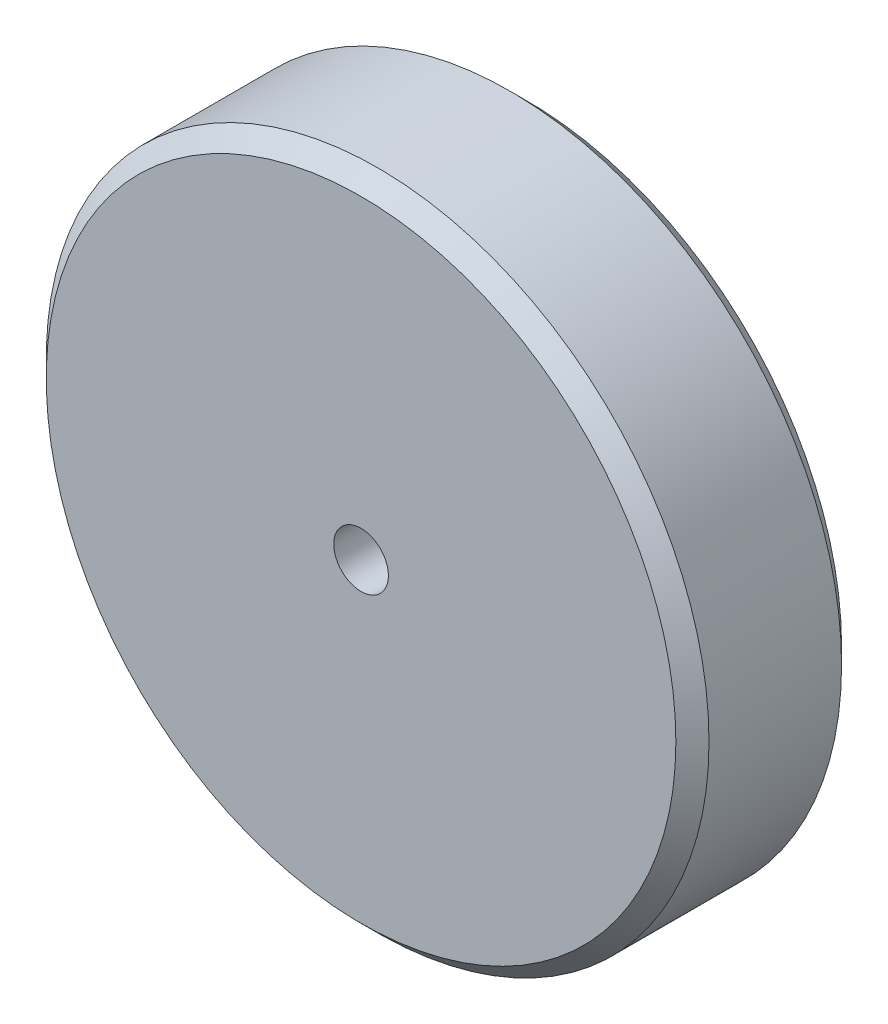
ISO-10303-21;
HEADER;
FILE_DESCRIPTION(('STEP AP214'),'2;1');
FILE_NAME('part.step','',(''),(''),'','','');
FILE_SCHEMA(('AUTOMOTIVE_DESIGN { 1 0 10303 214 1 1 1 1 }'));
ENDSEC;
DATA;
#1=APPLICATION_CONTEXT('core data for automotive mechanical design processes');
#2=APPLICATION_PROTOCOL_DEFINITION('international standard','automotive_design',2000,#1);
#3=PRODUCT_CONTEXT('',#1,'mechanical');
#4=PRODUCT('Part','Part','',(#3));
#5=PRODUCT_RELATED_PRODUCT_CATEGORY('part','',(#4));
#6=PRODUCT_DEFINITION_FORMATION('','',#4);
#7=PRODUCT_DEFINITION_CONTEXT('part definition',#1,'design');
#8=PRODUCT_DEFINITION('design','',#6,#7);
#9=PRODUCT_DEFINITION_SHAPE('','',#8);
#10=(LENGTH_UNIT() NAMED_UNIT(*) SI_UNIT(.MILLI.,.METRE.));
#11=(NAMED_UNIT(*) PLANE_ANGLE_UNIT() SI_UNIT($,.RADIAN.));
#12=(NAMED_UNIT(*) SI_UNIT($,.STERADIAN.) SOLID_ANGLE_UNIT());
#13=UNCERTAINTY_MEASURE_WITH_UNIT(LENGTH_MEASURE(1.E-05),#10,'distance_accuracy_value','');
#14=(GEOMETRIC_REPRESENTATION_CONTEXT(3) GLOBAL_UNCERTAINTY_ASSIGNED_CONTEXT((#13)) GLOBAL_UNIT_ASSIGNED_CONTEXT((#10,
#11,#12)) REPRESENTATION_CONTEXT('',''));
#15=CARTESIAN_POINT('',(0.,0.,0.));
#16=DIRECTION('',(0.,0.,1.));
#17=DIRECTION('',(1.,0.,0.));
#18=AXIS2_PLACEMENT_3D('',#15,#16,#17);
#19=CARTESIAN_POINT('',(0.,0.,10.));
#20=DIRECTION('',(0.,0.,-1.));
#21=DIRECTION('',(-1.,0.,0.));
#22=AXIS2_PLACEMENT_3D('',#19,#20,#21);
#23=CYLINDRICAL_SURFACE('',#22,20.);
#24=CARTESIAN_POINT('',(0.,0.,1.));
#25=DIRECTION('',(0.,0.,1.));
#26=DIRECTION('',(1.,0.,0.));
#27=AXIS2_PLACEMENT_3D('',#24,#25,#26);
#28=CIRCLE('',#27,20.);
#29=CARTESIAN_POINT('',(20.,0.,1.));
#30=VERTEX_POINT('',#29);
#31=EDGE_CURVE('E40',#30,#30,#28,.T.);
#32=ORIENTED_EDGE('',*,*,#31,.T.);
#33=EDGE_LOOP('',(#32));
#34=FACE_BOUND('',#33,.T.);
#35=CARTESIAN_POINT('',(0.,0.,9.00000000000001));
#36=DIRECTION('',(0.,0.,1.));
#37=DIRECTION('',(1.,0.,0.));
#38=AXIS2_PLACEMENT_3D('',#35,#36,#37);
#39=CIRCLE('',#38,20.);
#40=CARTESIAN_POINT('',(20.,0.,9.00000000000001));
#41=VERTEX_POINT('',#40);
#42=EDGE_CURVE('E44',#41,#41,#39,.F.);
#43=ORIENTED_EDGE('',*,*,#42,.T.);
#44=EDGE_LOOP('',(#43));
#45=FACE_BOUND('',#44,.T.);
#46=ADVANCED_FACE('F29',(#34,#45),#23,.T.);
#47=CARTESIAN_POINT('',(0.,0.,10.));
#48=DIRECTION('',(0.,0.,1.));
#49=DIRECTION('',(1.,0.,0.));
#50=AXIS2_PLACEMENT_3D('',#47,#48,#49);
#51=PLANE('',#50);
#52=CARTESIAN_POINT('',(0.,0.,10.));
#53=DIRECTION('',(0.,0.,1.));
#54=DIRECTION('',(1.,0.,0.));
#55=AXIS2_PLACEMENT_3D('',#52,#53,#54);
#56=CIRCLE('',#55,19.);
#57=CARTESIAN_POINT('',(19.,0.,10.));
#58=VERTEX_POINT('',#57);
#59=EDGE_CURVE('E10',#58,#58,#56,.T.);
#60=ORIENTED_EDGE('',*,*,#59,.T.);
#61=EDGE_LOOP('',(#60));
#62=FACE_BOUND('',#61,.T.);
#63=CARTESIAN_POINT('',(0.,0.,10.));
#64=DIRECTION('',(0.,0.,1.));
#65=DIRECTION('',(1.,0.,0.));
#66=AXIS2_PLACEMENT_3D('',#63,#64,#65);
#67=CIRCLE('',#66,1.64999999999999);
#68=CARTESIAN_POINT('',(1.64999999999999,0.,10.));
#69=VERTEX_POINT('',#68);
#70=EDGE_CURVE('E52',#69,#69,#67,.T.);
#71=ORIENTED_EDGE('',*,*,#70,.F.);
#72=EDGE_LOOP('',(#71));
#73=FACE_BOUND('',#72,.T.);
#74=ADVANCED_FACE('F58',(#62,#73),#51,.T.);
#75=CARTESIAN_POINT('',(0.,0.,0.));
#76=DIRECTION('',(0.,0.,1.));
#77=DIRECTION('',(1.,0.,0.));
#78=AXIS2_PLACEMENT_3D('',#75,#76,#77);
#79=PLANE('',#78);
#80=CARTESIAN_POINT('',(0.,0.,0.));
#81=DIRECTION('',(0.,0.,1.));
#82=DIRECTION('',(1.,0.,0.));
#83=AXIS2_PLACEMENT_3D('',#80,#81,#82);
#84=CIRCLE('',#83,19.);
#85=CARTESIAN_POINT('',(19.,0.,0.));
#86=VERTEX_POINT('',#85);
#87=EDGE_CURVE('E36',#86,#86,#84,.F.);
#88=ORIENTED_EDGE('',*,*,#87,.T.);
#89=EDGE_LOOP('',(#88));
#90=FACE_BOUND('',#89,.T.);
#91=CARTESIAN_POINT('',(0.,0.,0.));
#92=DIRECTION('',(0.,0.,1.));
#93=DIRECTION('',(1.,0.,0.));
#94=AXIS2_PLACEMENT_3D('',#91,#92,#93);
#95=CIRCLE('',#94,1.65);
#96=CARTESIAN_POINT('',(1.65,0.,0.));
#97=VERTEX_POINT('',#96);
#98=EDGE_CURVE('E49',#97,#97,#95,.T.);
#99=ORIENTED_EDGE('',*,*,#98,.T.);
#100=EDGE_LOOP('',(#99));
#101=FACE_BOUND('',#100,.T.);
#102=ADVANCED_FACE('F60',(#90,#101),#79,.F.);
#103=CARTESIAN_POINT('',(0.,0.,10.));
#104=DIRECTION('',(0.,0.,1.));
#105=DIRECTION('',(1.,0.,0.));
#106=AXIS2_PLACEMENT_3D('',#103,#104,#105);
#107=CYLINDRICAL_SURFACE('',#106,1.64999999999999);
#108=ORIENTED_EDGE('',*,*,#98,.F.);
#109=EDGE_LOOP('',(#108));
#110=FACE_BOUND('',#109,.T.);
#111=ORIENTED_EDGE('',*,*,#70,.T.);
#112=EDGE_LOOP('',(#111));
#113=FACE_BOUND('',#112,.T.);
#114=ADVANCED_FACE('F56',(#110,#113),#107,.F.);
#115=CARTESIAN_POINT('',(0.,0.,1.));
#116=DIRECTION('',(0.,0.,1.));
#117=DIRECTION('',(1.,0.,0.));
#118=AXIS2_PLACEMENT_3D('',#115,#116,#117);
#119=CONICAL_SURFACE('',#118,20.,0.78539816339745);
#120=ORIENTED_EDGE('',*,*,#87,.F.);
#121=EDGE_LOOP('',(#120));
#122=FACE_BOUND('',#121,.T.);
#123=ORIENTED_EDGE('',*,*,#31,.F.);
#124=EDGE_LOOP('',(#123));
#125=FACE_BOUND('',#124,.T.);
#126=ADVANCED_FACE('F70',(#122,#125),#119,.T.);
#127=CARTESIAN_POINT('',(0.,0.,10.));
#128=DIRECTION('',(0.,0.,-1.));
#129=DIRECTION('',(-1.,0.,0.));
#130=AXIS2_PLACEMENT_3D('',#127,#128,#129);
#131=CONICAL_SURFACE('',#130,19.,0.785398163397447);
#132=ORIENTED_EDGE('',*,*,#42,.F.);
#133=EDGE_LOOP('',(#132));
#134=FACE_BOUND('',#133,.T.);
#135=ORIENTED_EDGE('',*,*,#59,.F.);
#136=EDGE_LOOP('',(#135));
#137=FACE_BOUND('',#136,.T.);
#138=ADVANCED_FACE('F31',(#134,#137),#131,.T.);
#139=CLOSED_SHELL('',(#46,#74,#102,#114,#126,#138));
#140=MANIFOLD_SOLID_BREP('B2',#139);
#141=ADVANCED_BREP_SHAPE_REPRESENTATION('',(#18,#140),#14);
#142=SHAPE_DEFINITION_REPRESENTATION(#9,#141);
ENDSEC;
END-ISO-10303-21;
